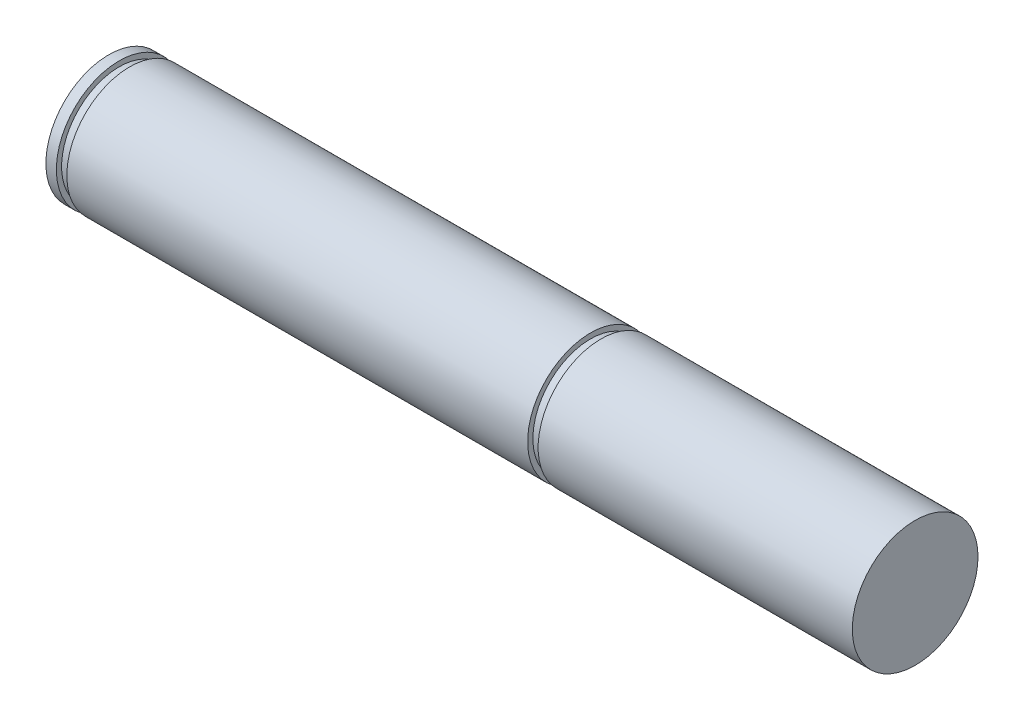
ISO-10303-21;
HEADER;
FILE_DESCRIPTION(('STEP AP214'),'2;1');
FILE_NAME('part.step','',(''),(''),'','','');
FILE_SCHEMA(('AUTOMOTIVE_DESIGN { 1 0 10303 214 1 1 1 1 }'));
ENDSEC;
DATA;
#1=APPLICATION_CONTEXT('core data for automotive mechanical design processes');
#2=APPLICATION_PROTOCOL_DEFINITION('international standard','automotive_design',2000,#1);
#3=PRODUCT_CONTEXT('',#1,'mechanical');
#4=PRODUCT('Part','Part','',(#3));
#5=PRODUCT_RELATED_PRODUCT_CATEGORY('part','',(#4));
#6=PRODUCT_DEFINITION_FORMATION('','',#4);
#7=PRODUCT_DEFINITION_CONTEXT('part definition',#1,'design');
#8=PRODUCT_DEFINITION('design','',#6,#7);
#9=PRODUCT_DEFINITION_SHAPE('','',#8);
#10=(LENGTH_UNIT() NAMED_UNIT(*) SI_UNIT(.MILLI.,.METRE.));
#11=(NAMED_UNIT(*) PLANE_ANGLE_UNIT() SI_UNIT($,.RADIAN.));
#12=(NAMED_UNIT(*) SI_UNIT($,.STERADIAN.) SOLID_ANGLE_UNIT());
#13=UNCERTAINTY_MEASURE_WITH_UNIT(LENGTH_MEASURE(1.E-05),#10,'distance_accuracy_value','');
#14=(GEOMETRIC_REPRESENTATION_CONTEXT(3) GLOBAL_UNCERTAINTY_ASSIGNED_CONTEXT((#13)) GLOBAL_UNIT_ASSIGNED_CONTEXT((#10,
#11,#12)) REPRESENTATION_CONTEXT('',''));
#15=CARTESIAN_POINT('',(0.,0.,0.));
#16=DIRECTION('',(0.,0.,1.));
#17=DIRECTION('',(1.,0.,0.));
#18=AXIS2_PLACEMENT_3D('',#15,#16,#17);
#19=CARTESIAN_POINT('',(1.,0.,0.));
#20=DIRECTION('',(-1.,0.,0.));
#21=DIRECTION('',(0.,0.,1.));
#22=AXIS2_PLACEMENT_3D('',#19,#20,#21);
#23=CYLINDRICAL_SURFACE('',#22,6.);
#24=CARTESIAN_POINT('',(1.,0.,0.));
#25=DIRECTION('',(1.,0.,0.));
#26=DIRECTION('',(0.,0.,-1.));
#27=AXIS2_PLACEMENT_3D('',#24,#25,#26);
#28=CIRCLE('',#27,6.);
#29=CARTESIAN_POINT('',(1.,0.,-6.));
#30=VERTEX_POINT('',#29);
#31=EDGE_CURVE('E10',#30,#30,#28,.T.);
#32=ORIENTED_EDGE('',*,*,#31,.F.);
#33=EDGE_LOOP('',(#32));
#34=FACE_BOUND('',#33,.T.);
#35=CARTESIAN_POINT('',(0.,0.,0.));
#36=DIRECTION('',(1.,0.,0.));
#37=DIRECTION('',(0.,0.,-1.));
#38=AXIS2_PLACEMENT_3D('',#35,#36,#37);
#39=CIRCLE('',#38,6.);
#40=CARTESIAN_POINT('',(0.,0.,-6.));
#41=VERTEX_POINT('',#40);
#42=EDGE_CURVE('E37',#41,#41,#39,.T.);
#43=ORIENTED_EDGE('',*,*,#42,.T.);
#44=EDGE_LOOP('',(#43));
#45=FACE_BOUND('',#44,.T.);
#46=ADVANCED_FACE('F34',(#34,#45),#23,.T.);
#47=CARTESIAN_POINT('',(1.,0.,0.));
#48=DIRECTION('',(1.,0.,0.));
#49=DIRECTION('',(0.,0.,-1.));
#50=AXIS2_PLACEMENT_3D('',#47,#48,#49);
#51=PLANE('',#50);
#52=CARTESIAN_POINT('',(1.,0.,0.));
#53=DIRECTION('',(1.,0.,0.));
#54=DIRECTION('',(0.,0.,-1.));
#55=AXIS2_PLACEMENT_3D('',#52,#53,#54);
#56=CIRCLE('',#55,5.5);
#57=CARTESIAN_POINT('',(1.,0.,-5.5));
#58=VERTEX_POINT('',#57);
#59=EDGE_CURVE('E46',#58,#58,#56,.T.);
#60=ORIENTED_EDGE('',*,*,#59,.F.);
#61=EDGE_LOOP('',(#60));
#62=FACE_BOUND('',#61,.T.);
#63=ORIENTED_EDGE('',*,*,#31,.T.);
#64=EDGE_LOOP('',(#63));
#65=FACE_BOUND('',#64,.T.);
#66=ADVANCED_FACE('F88',(#62,#65),#51,.T.);
#67=CARTESIAN_POINT('',(0.,0.,0.));
#68=DIRECTION('',(1.,0.,0.));
#69=DIRECTION('',(0.,0.,-1.));
#70=AXIS2_PLACEMENT_3D('',#67,#68,#69);
#71=PLANE('',#70);
#72=ORIENTED_EDGE('',*,*,#42,.F.);
#73=EDGE_LOOP('',(#72));
#74=FACE_BOUND('',#73,.T.);
#75=ADVANCED_FACE('F93',(#74),#71,.F.);
#76=CARTESIAN_POINT('',(2.,0.,0.));
#77=DIRECTION('',(-1.,0.,0.));
#78=DIRECTION('',(0.,0.,1.));
#79=AXIS2_PLACEMENT_3D('',#76,#77,#78);
#80=CYLINDRICAL_SURFACE('',#79,5.5);
#81=CARTESIAN_POINT('',(2.,0.,0.));
#82=DIRECTION('',(1.,0.,0.));
#83=DIRECTION('',(0.,0.,-1.));
#84=AXIS2_PLACEMENT_3D('',#81,#82,#83);
#85=CIRCLE('',#84,5.5);
#86=CARTESIAN_POINT('',(2.,0.,-5.5));
#87=VERTEX_POINT('',#86);
#88=EDGE_CURVE('E44',#87,#87,#85,.T.);
#89=ORIENTED_EDGE('',*,*,#88,.F.);
#90=EDGE_LOOP('',(#89));
#91=FACE_BOUND('',#90,.T.);
#92=ORIENTED_EDGE('',*,*,#59,.T.);
#93=EDGE_LOOP('',(#92));
#94=FACE_BOUND('',#93,.T.);
#95=ADVANCED_FACE('F100',(#91,#94),#80,.T.);
#96=CARTESIAN_POINT('',(46.,0.,0.));
#97=DIRECTION('',(-1.,0.,0.));
#98=DIRECTION('',(0.,0.,1.));
#99=AXIS2_PLACEMENT_3D('',#96,#97,#98);
#100=CYLINDRICAL_SURFACE('',#99,6.);
#101=CARTESIAN_POINT('',(46.,0.,0.));
#102=DIRECTION('',(1.,0.,0.));
#103=DIRECTION('',(0.,0.,-1.));
#104=AXIS2_PLACEMENT_3D('',#101,#102,#103);
#105=CIRCLE('',#104,6.);
#106=CARTESIAN_POINT('',(46.,0.,-6.));
#107=VERTEX_POINT('',#106);
#108=EDGE_CURVE('E49',#107,#107,#105,.T.);
#109=ORIENTED_EDGE('',*,*,#108,.F.);
#110=EDGE_LOOP('',(#109));
#111=FACE_BOUND('',#110,.T.);
#112=CARTESIAN_POINT('',(2.,0.,0.));
#113=DIRECTION('',(1.,0.,0.));
#114=DIRECTION('',(0.,0.,-1.));
#115=AXIS2_PLACEMENT_3D('',#112,#113,#114);
#116=CIRCLE('',#115,6.);
#117=CARTESIAN_POINT('',(2.,0.,-6.));
#118=VERTEX_POINT('',#117);
#119=EDGE_CURVE('E52',#118,#118,#116,.T.);
#120=ORIENTED_EDGE('',*,*,#119,.T.);
#121=EDGE_LOOP('',(#120));
#122=FACE_BOUND('',#121,.T.);
#123=ADVANCED_FACE('F104',(#111,#122),#100,.T.);
#124=CARTESIAN_POINT('',(46.,0.,0.));
#125=DIRECTION('',(1.,0.,0.));
#126=DIRECTION('',(0.,0.,-1.));
#127=AXIS2_PLACEMENT_3D('',#124,#125,#126);
#128=PLANE('',#127);
#129=CARTESIAN_POINT('',(46.,0.,0.));
#130=DIRECTION('',(1.,0.,0.));
#131=DIRECTION('',(0.,0.,-1.));
#132=AXIS2_PLACEMENT_3D('',#129,#130,#131);
#133=CIRCLE('',#132,5.5);
#134=CARTESIAN_POINT('',(46.,0.,-5.5));
#135=VERTEX_POINT('',#134);
#136=EDGE_CURVE('E58',#135,#135,#133,.T.);
#137=ORIENTED_EDGE('',*,*,#136,.F.);
#138=EDGE_LOOP('',(#137));
#139=FACE_BOUND('',#138,.T.);
#140=ORIENTED_EDGE('',*,*,#108,.T.);
#141=EDGE_LOOP('',(#140));
#142=FACE_BOUND('',#141,.T.);
#143=ADVANCED_FACE('F110',(#139,#142),#128,.T.);
#144=CARTESIAN_POINT('',(2.,0.,0.));
#145=DIRECTION('',(1.,0.,0.));
#146=DIRECTION('',(0.,0.,-1.));
#147=AXIS2_PLACEMENT_3D('',#144,#145,#146);
#148=PLANE('',#147);
#149=ORIENTED_EDGE('',*,*,#88,.T.);
#150=EDGE_LOOP('',(#149));
#151=FACE_BOUND('',#150,.T.);
#152=ORIENTED_EDGE('',*,*,#119,.F.);
#153=EDGE_LOOP('',(#152));
#154=FACE_BOUND('',#153,.T.);
#155=ADVANCED_FACE('F112',(#151,#154),#148,.F.);
#156=CARTESIAN_POINT('',(47.,0.,0.));
#157=DIRECTION('',(-1.,0.,0.));
#158=DIRECTION('',(0.,0.,1.));
#159=AXIS2_PLACEMENT_3D('',#156,#157,#158);
#160=CYLINDRICAL_SURFACE('',#159,5.5);
#161=CARTESIAN_POINT('',(47.,0.,0.));
#162=DIRECTION('',(1.,0.,0.));
#163=DIRECTION('',(0.,0.,-1.));
#164=AXIS2_PLACEMENT_3D('',#161,#162,#163);
#165=CIRCLE('',#164,5.5);
#166=CARTESIAN_POINT('',(47.,0.,-5.5));
#167=VERTEX_POINT('',#166);
#168=EDGE_CURVE('E55',#167,#167,#165,.T.);
#169=ORIENTED_EDGE('',*,*,#168,.F.);
#170=EDGE_LOOP('',(#169));
#171=FACE_BOUND('',#170,.T.);
#172=ORIENTED_EDGE('',*,*,#136,.T.);
#173=EDGE_LOOP('',(#172));
#174=FACE_BOUND('',#173,.T.);
#175=ADVANCED_FACE('F75',(#171,#174),#160,.T.);
#176=CARTESIAN_POINT('',(77.,0.,0.));
#177=DIRECTION('',(-1.,0.,0.));
#178=DIRECTION('',(0.,0.,1.));
#179=AXIS2_PLACEMENT_3D('',#176,#177,#178);
#180=CYLINDRICAL_SURFACE('',#179,6.);
#181=CARTESIAN_POINT('',(77.,0.,0.));
#182=DIRECTION('',(1.,0.,0.));
#183=DIRECTION('',(0.,0.,-1.));
#184=AXIS2_PLACEMENT_3D('',#181,#182,#183);
#185=CIRCLE('',#184,6.);
#186=CARTESIAN_POINT('',(77.,0.,-6.));
#187=VERTEX_POINT('',#186);
#188=EDGE_CURVE('E61',#187,#187,#185,.T.);
#189=ORIENTED_EDGE('',*,*,#188,.F.);
#190=EDGE_LOOP('',(#189));
#191=FACE_BOUND('',#190,.T.);
#192=CARTESIAN_POINT('',(47.,0.,0.));
#193=DIRECTION('',(1.,0.,0.));
#194=DIRECTION('',(0.,0.,-1.));
#195=AXIS2_PLACEMENT_3D('',#192,#193,#194);
#196=CIRCLE('',#195,6.);
#197=CARTESIAN_POINT('',(47.,0.,-6.));
#198=VERTEX_POINT('',#197);
#199=EDGE_CURVE('E64',#198,#198,#196,.T.);
#200=ORIENTED_EDGE('',*,*,#199,.T.);
#201=EDGE_LOOP('',(#200));
#202=FACE_BOUND('',#201,.T.);
#203=ADVANCED_FACE('F72',(#191,#202),#180,.T.);
#204=CARTESIAN_POINT('',(77.,0.,0.));
#205=DIRECTION('',(1.,0.,0.));
#206=DIRECTION('',(0.,0.,-1.));
#207=AXIS2_PLACEMENT_3D('',#204,#205,#206);
#208=PLANE('',#207);
#209=ORIENTED_EDGE('',*,*,#188,.T.);
#210=EDGE_LOOP('',(#209));
#211=FACE_BOUND('',#210,.T.);
#212=ADVANCED_FACE('F70',(#211),#208,.T.);
#213=CARTESIAN_POINT('',(47.,0.,0.));
#214=DIRECTION('',(1.,0.,0.));
#215=DIRECTION('',(0.,0.,-1.));
#216=AXIS2_PLACEMENT_3D('',#213,#214,#215);
#217=PLANE('',#216);
#218=ORIENTED_EDGE('',*,*,#168,.T.);
#219=EDGE_LOOP('',(#218));
#220=FACE_BOUND('',#219,.T.);
#221=ORIENTED_EDGE('',*,*,#199,.F.);
#222=EDGE_LOOP('',(#221));
#223=FACE_BOUND('',#222,.T.);
#224=ADVANCED_FACE('F79',(#220,#223),#217,.F.);
#225=CLOSED_SHELL('',(#46,#66,#75,#95,#123,#143,#155,#175,#203,#212,#224));
#226=MANIFOLD_SOLID_BREP('B2',#225);
#227=ADVANCED_BREP_SHAPE_REPRESENTATION('',(#18,#226),#14);
#228=SHAPE_DEFINITION_REPRESENTATION(#9,#227);
ENDSEC;
END-ISO-10303-21;
